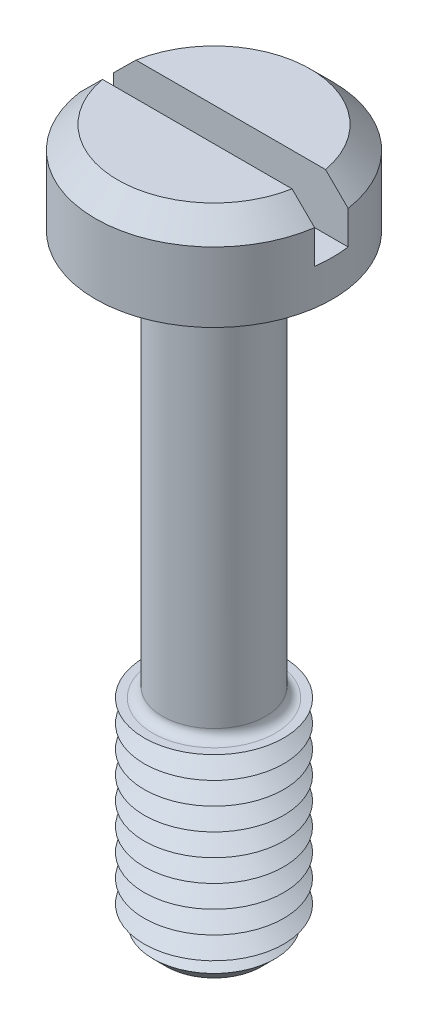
from build123d import *

# Parameters (mm, degrees)
SKETCH1_R           = 4.25
BOSS_EXTRUDE1_DEPTH = 3.3
SKETCH2_R           = 1.85
BOSS_EXTRUDE2_DEPTH = 22
SKETCH3_R           = 2.5
BOSS_EXTRUDE3_DEPTH = 7.5
CHAMFER1_SIZE       = 0.8
LPATTERN1_COUNT     = 9
LPATTERN1_PITCH     = 0.8
FILLET1_R           = 0.35
CHAMFER2_SIZE       = 0.8
SKETCH6_W           = 8.5
SKETCH6_H           = 1.2
CUT_EXTRUDE1_DEPTH  = 2


with BuildPart() as part:
    # Sketch1 → Boss-Extrude1 (new body)
    with BuildSketch(Plane(origin=(0, 0, 0), x_dir=(1, 0, 0), z_dir=(0, 1, 0))):
        with Locations(Location((0, 0, 0), (0, 0, 270))):
            Circle(SKETCH1_R)
    extrude(amount=BOSS_EXTRUDE1_DEPTH)

    # Sketch2 → Boss-Extrude2 (add)
    with BuildSketch(Plane.XZ):
        with Locations(Location((0, 0, 0), (0, 0, 270))):
            Circle(SKETCH2_R)
    extrude(amount=BOSS_EXTRUDE2_DEPTH)

    # Sketch3 → Boss-Extrude3 (add)
    with BuildSketch(Plane.XZ.offset(22)):
        with Locations(Location((0, 0, 0), (0, 0, 270))):
            Circle(SKETCH3_R)
    extrude(amount=-BOSS_EXTRUDE3_DEPTH)

    # Chamfer1
    chamfer1_edges = [part.edges().sort_by_distance(p)[0] for p in [
        (0, -22, 2.5),
    ]]
    chamfer(chamfer1_edges, length=CHAMFER1_SIZE)

    # Sketch5 → Cut-Revolve1 (revolve, cut)
    with BuildSketch(Plane(origin=(0, 0, 0), x_dir=(0, 0, -1), z_dir=(1, 0, 0))):
        Polygon((-2.5, -14.5), (-1.807179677, -14.9), (-2.5, -15.3), align=None)
    cut_revolve1 = revolve(axis=Axis((0, -6.58711856, 0), (0, -1, 0)), mode=Mode.SUBTRACT)

    # LPattern1: Cut-Revolve1 ×9
    with Locations(*[(0, -i * LPATTERN1_PITCH, 0) for i in range(1, LPATTERN1_COUNT)]):
        add(cut_revolve1, mode=Mode.SUBTRACT)

    # Fillet1
    fillet1_edges = [part.edges().sort_by_distance(p)[0] for p in [
        (0, 0, 1.85),
        (0, -14.5, 1.85),
    ]]
    fillet(fillet1_edges, radius=FILLET1_R)

    # Chamfer2
    chamfer2_edges = [part.edges().sort_by_distance(p)[0] for p in [
        (0, 3.3, -4.25),
    ]]
    chamfer(chamfer2_edges, length=CHAMFER2_SIZE)

    # Sketch6 → Cut-Extrude1 (cut)
    with BuildSketch(Plane(origin=(0, 3.3, 0), x_dir=(1, 0, 0), z_dir=(0, 1, 0))):
        Rectangle(SKETCH6_W, SKETCH6_H)
    extrude(amount=-CUT_EXTRUDE1_DEPTH, mode=Mode.SUBTRACT)


solid = part.part
